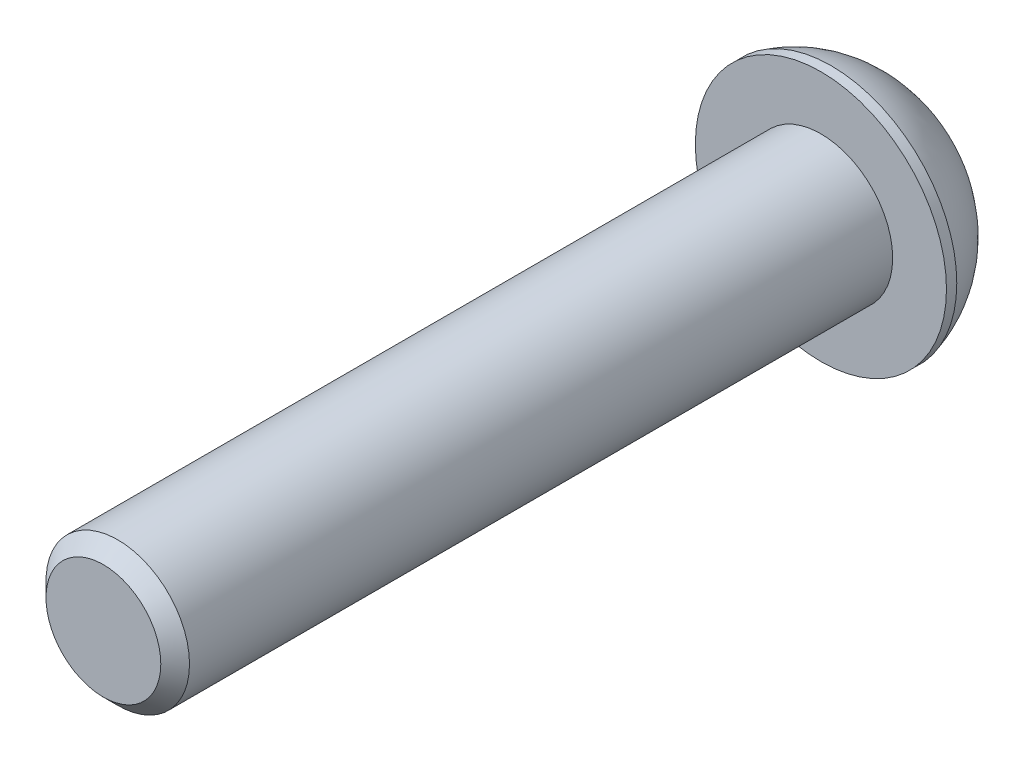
from build123d import *

# Parameters (mm, degrees)
ENLEV_MAT_EXTRU1_DEPTH = 2.6
ESQUISSE3_W            = 4
ESQUISSE3_H            = 40
CHANFREIN1_SIZE        = 0.8


with BuildPart() as part:
    # Esquisse1 → Base-R_volution (revolve)
    with BuildSketch(Plane(origin=(0, 0, 0), x_dir=(1, 0, 0), z_dir=(0, 1, 0)), mode=Mode.PRIVATE) as base_r_volution_sk:
        with BuildLine():
            Line((0, 0), (7, 0))
            Line((7, 0), (7, 0.574933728))
            ThreePointArc((7, 0.574933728), (5.912888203, 2.77937838), (4.064923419, 4.4))
            Line((4.064923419, 4.4), (0, 4.4))
            Line((0, 4.4), (0, 0))
        make_face()
    revolve(base_r_volution_sk.sketch.rotate(Axis((0, 0, 0), (0, 0, -1)), 180), axis=Axis((0, 0, 0), (0, 0, -1)))

    # Esquisse2 → enlev-mat-Extru1 (cut)
    with BuildSketch(Plane.XY.offset(-4.4)):
        Polygon((2.5, -1.443375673), (2.5, 1.443375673), (0, 2.886751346), (-2.5, 1.443375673), (-2.5, -1.443375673), (0, -2.886751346), align=None)
    extrude(amount=ENLEV_MAT_EXTRU1_DEPTH, mode=Mode.SUBTRACT)

    # Esquisse3 → Boss.-R_vol.1 (revolve)
    with BuildSketch(Plane(origin=(0, 0, 0), x_dir=(1, 0, 0), z_dir=(0, 1, 0)), mode=Mode.PRIVATE) as boss_r_vol_1_sk:
        with Locations((2, -20)):
            Rectangle(ESQUISSE3_W, ESQUISSE3_H)
    revolve(boss_r_vol_1_sk.sketch.rotate(Axis((0, 0, 0), (0, 0, 1)), 180), axis=Axis((0, 0, 0), (0, 0, 1)))

    # Chanfrein1
    chanfrein1_edges = [part.edges().sort_by_distance(p)[0] for p in [
        (4, 0, 40),
    ]]
    chamfer(chanfrein1_edges, length=CHANFREIN1_SIZE)


solid = part.part
